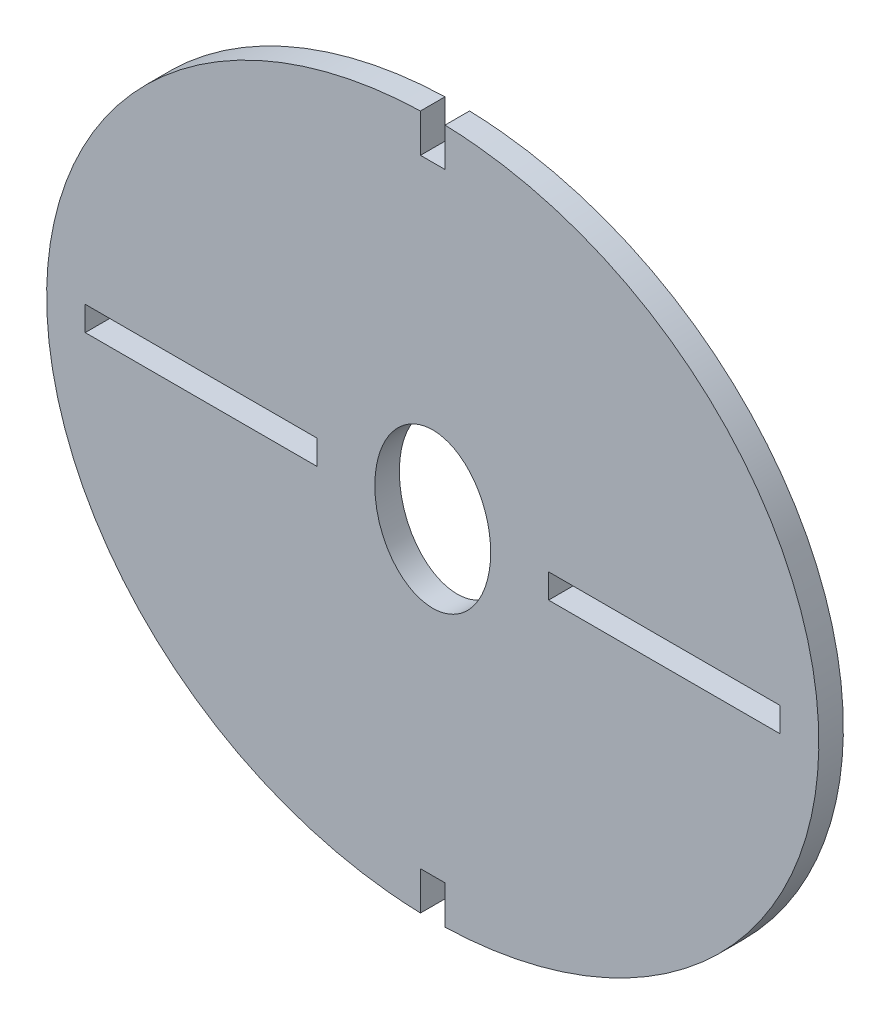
from build123d import *

# Parameters (mm, degrees)
SKETCH1_RX          = 50
SKETCH1_RY          = 45
SKETCH1_RX_2        = 10
SKETCH1_RY_2        = 7.5
SKETCH1_W           = 30
SKETCH1_H           = 3.175
BOSS_EXTRUDE1_DEPTH = 3.175
CUT_EXTRUDE1_DEPTH  = 10


with BuildPart() as part:
    # Sketch1 → Boss-Extrude1 (new body)
    with BuildSketch(Plane.XY):
        with Locations(Location((0, 0), (0, 0, 180))):
            Ellipse(SKETCH1_RX, SKETCH1_RY)
        with Locations(Location((0, 0), (0, 0, -90))):
            Ellipse(SKETCH1_RX_2, SKETCH1_RY_2, mode=Mode.SUBTRACT)
        with Locations((-30, 0)):
            Rectangle(SKETCH1_W, SKETCH1_H, mode=Mode.SUBTRACT)
        with Locations((30, 0)):
            Rectangle(SKETCH1_W, SKETCH1_H, mode=Mode.SUBTRACT)
    extrude(amount=BOSS_EXTRUDE1_DEPTH)

    # Sketch2 → Cut-Extrude1 (cut)
    with BuildSketch(Plane.XY.offset(3.175)):
        Polygon((0, 40), (-1.5875, 40), (-1.5875, 56.86342243), (1.5875, 56.86342243), (1.5875, 40), align=None)
        Polygon((-1.5875, -56.86342243), (1.5875, -56.86342243), (1.5875, -40), (0, -40), (-1.5875, -40), align=None)
    extrude(amount=-CUT_EXTRUDE1_DEPTH, mode=Mode.SUBTRACT)


solid = part.part
